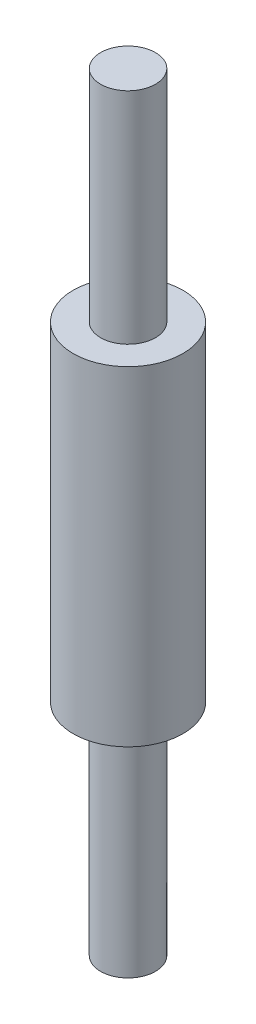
from build123d import *

# Parameters (mm, degrees)
SKETCH1_R           = 6.35
BOSS_EXTRUDE1_DEPTH = 88.9
SKETCH2_OUTSIDE_W   = 32.84
SKETCH2_OUTSIDE_H   = 32.84
SKETCH2_OUTSIDE_R   = 3.175
CUT_EXTRUDE1_DEPTH  = 25.4
SKETCH3_OUTSIDE_W   = 32.84
SKETCH3_OUTSIDE_H   = 32.84
SKETCH3_OUTSIDE_R   = 3.175
CUT_EXTRUDE2_DEPTH  = 25.4


with BuildPart() as part:
    # Sketch1 → Boss-Extrude1 (new body)
    with BuildSketch(Plane(origin=(0, 0, 0), x_dir=(1, 0, 0), z_dir=(0, 1, 0))):
        with Locations(Location((0, 0, 0), (0, 0, 270))):
            Circle(SKETCH1_R)
    extrude(amount=BOSS_EXTRUDE1_DEPTH)

    # Sketch2 outside → Cut-Extrude1 (cut)
    with BuildSketch(Plane.XZ):
        Rectangle(SKETCH2_OUTSIDE_W, SKETCH2_OUTSIDE_H)
        with Locations(Location((0, 0, 0), (0, 0, 270))):
            Circle(SKETCH2_OUTSIDE_R, mode=Mode.SUBTRACT)
    extrude(amount=-CUT_EXTRUDE1_DEPTH, mode=Mode.SUBTRACT)

    # Sketch3 outside → Cut-Extrude2 (cut)
    with BuildSketch(Plane(origin=(0, 88.9, 0), x_dir=(1, 0, 0), z_dir=(0, 1, 0))):
        Rectangle(SKETCH3_OUTSIDE_W, SKETCH3_OUTSIDE_H)
        with Locations(Location((0, 0, 0), (0, 0, 90))):
            Circle(SKETCH3_OUTSIDE_R, mode=Mode.SUBTRACT)
    extrude(amount=-CUT_EXTRUDE2_DEPTH, mode=Mode.SUBTRACT)


solid = part.part
